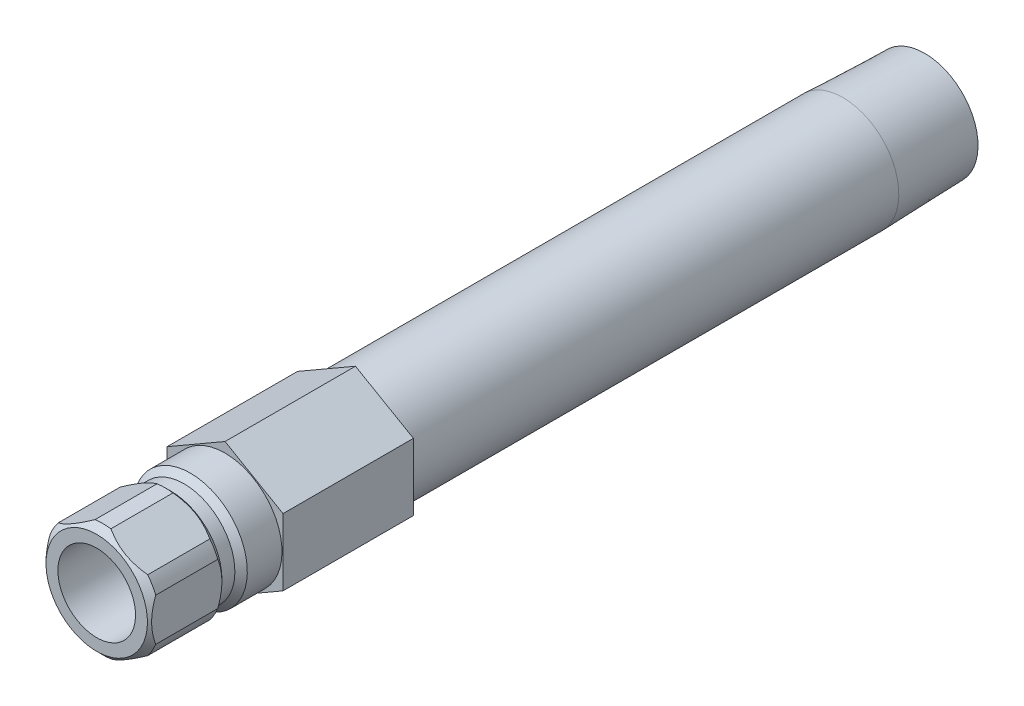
from build123d import *

# Parameters (mm, degrees)
SKETCH2_R           = 4.6228
BOSS_EXTRUDE1_DEPTH = 16.002
CUT_EXTRUDE1_START  = 6.604
SKETCH3_OUTSIDE_W   = 37.004
SKETCH3_OUTSIDE_H   = 39.204
CUT_EXTRUDE1_DEPTH  = 80.932623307


with BuildPart() as part:
    # Sketch1 → Revolve1 (revolve)
    with BuildSketch(Plane(origin=(0, 0, 0), x_dir=(0, 0, -1), z_dir=(1, 0, 0))):
        Polygon((-15.748, 4.7625), (-15.748, 6.223), (-14.986, 6.985), (-7.366, 6.985), (-6.604, 6.223), (-5.0165, 6.223), (-4.2545, 6.985), (0, 6.985), (0, 6.858), (75.819, 6.858), (85.852, 6.544470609), (85.852, 4.6228), (-3.481720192, 4.6228), (-3.556, 4.7625), align=None)
    revolve(axis=Axis((0, 0, 12.87483316), (0, 0, 1)))

    # Sketch2 → Boss-Extrude1 (add)
    with BuildSketch(Plane.XY):
        Polygon((-7.112, 4.106115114), (-7.112, -4.106115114), (0, -8.212230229), (7.112, -4.106115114), (7.112, 4.106115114), (0, 8.212230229), align=None)
        with Locations(Location((0, 0, 0), (0, 0, 90))):
            Circle(SKETCH2_R, mode=Mode.SUBTRACT)
    extrude(amount=-BOSS_EXTRUDE1_DEPTH)

    # Sketch3 outside → Cut-Extrude1 (cut, through all)
    with BuildSketch(Plane.XY.offset(CUT_EXTRUDE1_START)):
        Rectangle(SKETCH3_OUTSIDE_W, SKETCH3_OUTSIDE_H)
        Polygon((6.477, -3.739497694), (6.477, 3.739497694), (0, 7.478995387), (-6.477, 3.739497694), (-6.477, -3.739497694), (0, -7.478995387), align=None, mode=Mode.SUBTRACT)
    extrude(amount=CUT_EXTRUDE1_DEPTH, mode=Mode.SUBTRACT)


solid = part.part
